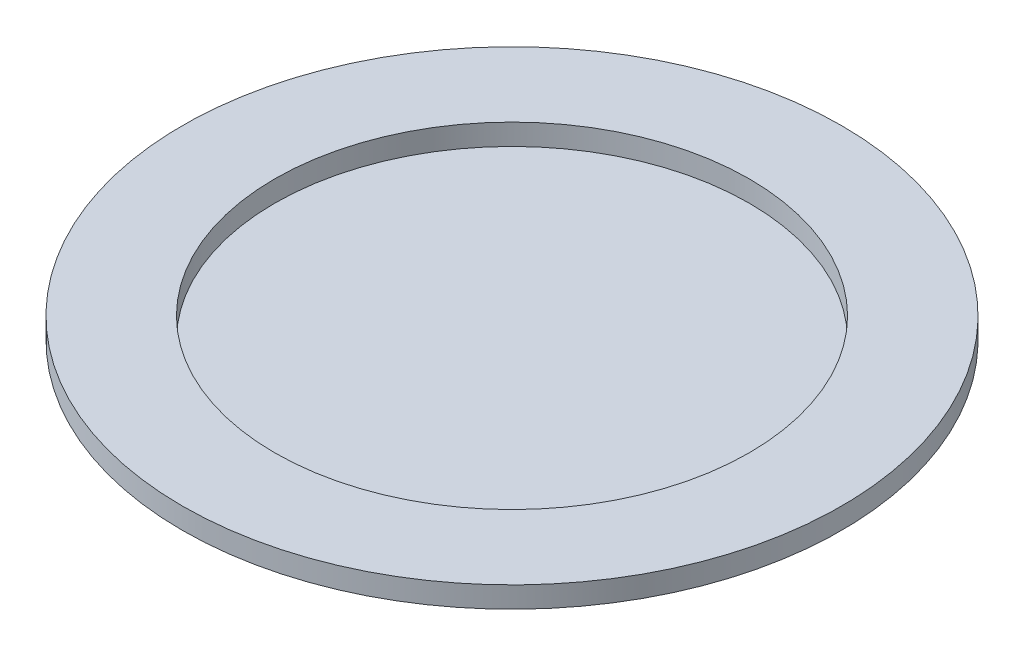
ISO-10303-21;
HEADER;
FILE_DESCRIPTION(('STEP AP214'),'2;1');
FILE_NAME('part.step','',(''),(''),'','','');
FILE_SCHEMA(('AUTOMOTIVE_DESIGN { 1 0 10303 214 1 1 1 1 }'));
ENDSEC;
DATA;
#1=APPLICATION_CONTEXT('core data for automotive mechanical design processes');
#2=APPLICATION_PROTOCOL_DEFINITION('international standard','automotive_design',2000,#1);
#3=PRODUCT_CONTEXT('',#1,'mechanical');
#4=PRODUCT('Part','Part','',(#3));
#5=PRODUCT_RELATED_PRODUCT_CATEGORY('part','',(#4));
#6=PRODUCT_DEFINITION_FORMATION('','',#4);
#7=PRODUCT_DEFINITION_CONTEXT('part definition',#1,'design');
#8=PRODUCT_DEFINITION('design','',#6,#7);
#9=PRODUCT_DEFINITION_SHAPE('','',#8);
#10=(LENGTH_UNIT() NAMED_UNIT(*) SI_UNIT(.MILLI.,.METRE.));
#11=(NAMED_UNIT(*) PLANE_ANGLE_UNIT() SI_UNIT($,.RADIAN.));
#12=(NAMED_UNIT(*) SI_UNIT($,.STERADIAN.) SOLID_ANGLE_UNIT());
#13=UNCERTAINTY_MEASURE_WITH_UNIT(LENGTH_MEASURE(1.E-05),#10,'distance_accuracy_value','');
#14=(GEOMETRIC_REPRESENTATION_CONTEXT(3) GLOBAL_UNCERTAINTY_ASSIGNED_CONTEXT((#13)) GLOBAL_UNIT_ASSIGNED_CONTEXT((#10,
#11,#12)) REPRESENTATION_CONTEXT('',''));
#15=CARTESIAN_POINT('',(0.,0.,0.));
#16=DIRECTION('',(0.,0.,1.));
#17=DIRECTION('',(1.,0.,0.));
#18=AXIS2_PLACEMENT_3D('',#15,#16,#17);
#19=CARTESIAN_POINT('',(0.,4.,0.));
#20=DIRECTION('',(0.,-1.,0.));
#21=DIRECTION('',(0.,0.,-1.));
#22=AXIS2_PLACEMENT_3D('',#19,#20,#21);
#23=CYLINDRICAL_SURFACE('',#22,50.);
#24=CARTESIAN_POINT('',(0.,4.,0.));
#25=DIRECTION('',(0.,1.,0.));
#26=DIRECTION('',(0.,0.,1.));
#27=AXIS2_PLACEMENT_3D('',#24,#25,#26);
#28=CIRCLE('',#27,50.);
#29=CARTESIAN_POINT('',(0.,4.,50.));
#30=VERTEX_POINT('',#29);
#31=EDGE_CURVE('E46',#30,#30,#28,.T.);
#32=ORIENTED_EDGE('',*,*,#31,.F.);
#33=EDGE_LOOP('',(#32));
#34=FACE_BOUND('',#33,.T.);
#35=CARTESIAN_POINT('',(0.,0.,0.));
#36=DIRECTION('',(0.,1.,0.));
#37=DIRECTION('',(0.,0.,1.));
#38=AXIS2_PLACEMENT_3D('',#35,#36,#37);
#39=CIRCLE('',#38,50.);
#40=CARTESIAN_POINT('',(0.,0.,50.));
#41=VERTEX_POINT('',#40);
#42=EDGE_CURVE('E51',#41,#41,#39,.T.);
#43=ORIENTED_EDGE('',*,*,#42,.T.);
#44=EDGE_LOOP('',(#43));
#45=FACE_BOUND('',#44,.T.);
#46=ADVANCED_FACE('F39',(#34,#45),#23,.T.);
#47=CARTESIAN_POINT('',(0.,0.,0.));
#48=DIRECTION('',(0.,1.,0.));
#49=DIRECTION('',(0.,0.,1.));
#50=AXIS2_PLACEMENT_3D('',#47,#48,#49);
#51=PLANE('',#50);
#52=ORIENTED_EDGE('',*,*,#42,.F.);
#53=EDGE_LOOP('',(#52));
#54=FACE_BOUND('',#53,.T.);
#55=ADVANCED_FACE('F76',(#54),#51,.F.);
#56=CARTESIAN_POINT('',(0.,8.,0.));
#57=DIRECTION('',(0.,1.,0.));
#58=DIRECTION('',(0.,0.,1.));
#59=AXIS2_PLACEMENT_3D('',#56,#57,#58);
#60=PLANE('',#59);
#61=CARTESIAN_POINT('',(0.,8.,0.));
#62=DIRECTION('',(0.,1.,0.));
#63=DIRECTION('',(0.,0.,1.));
#64=AXIS2_PLACEMENT_3D('',#61,#62,#63);
#65=CIRCLE('',#64,62.5);
#66=CARTESIAN_POINT('',(0.,8.,62.5));
#67=VERTEX_POINT('',#66);
#68=EDGE_CURVE('E57',#67,#67,#65,.T.);
#69=ORIENTED_EDGE('',*,*,#68,.T.);
#70=EDGE_LOOP('',(#69));
#71=FACE_BOUND('',#70,.T.);
#72=CARTESIAN_POINT('',(0.,8.,0.));
#73=DIRECTION('',(0.,1.,0.));
#74=DIRECTION('',(0.,0.,1.));
#75=AXIS2_PLACEMENT_3D('',#72,#73,#74);
#76=CIRCLE('',#75,45.);
#77=CARTESIAN_POINT('',(0.,8.,45.));
#78=VERTEX_POINT('',#77);
#79=EDGE_CURVE('E63',#78,#78,#76,.T.);
#80=ORIENTED_EDGE('',*,*,#79,.F.);
#81=EDGE_LOOP('',(#80));
#82=FACE_BOUND('',#81,.T.);
#83=ADVANCED_FACE('F73',(#71,#82),#60,.T.);
#84=CARTESIAN_POINT('',(0.,4.,0.));
#85=DIRECTION('',(0.,1.,0.));
#86=DIRECTION('',(0.,0.,1.));
#87=AXIS2_PLACEMENT_3D('',#84,#85,#86);
#88=PLANE('',#87);
#89=ORIENTED_EDGE('',*,*,#31,.T.);
#90=EDGE_LOOP('',(#89));
#91=FACE_BOUND('',#90,.T.);
#92=CARTESIAN_POINT('',(0.,4.,0.));
#93=DIRECTION('',(0.,1.,0.));
#94=DIRECTION('',(0.,0.,1.));
#95=AXIS2_PLACEMENT_3D('',#92,#93,#94);
#96=CIRCLE('',#95,62.5);
#97=CARTESIAN_POINT('',(0.,4.,62.5));
#98=VERTEX_POINT('',#97);
#99=EDGE_CURVE('E59',#98,#98,#96,.T.);
#100=ORIENTED_EDGE('',*,*,#99,.F.);
#101=EDGE_LOOP('',(#100));
#102=FACE_BOUND('',#101,.T.);
#103=ADVANCED_FACE('F75',(#91,#102),#88,.F.);
#104=CARTESIAN_POINT('',(0.,8.,0.));
#105=DIRECTION('',(0.,-1.,0.));
#106=DIRECTION('',(0.,0.,-1.));
#107=AXIS2_PLACEMENT_3D('',#104,#105,#106);
#108=CYLINDRICAL_SURFACE('',#107,62.5);
#109=ORIENTED_EDGE('',*,*,#68,.F.);
#110=EDGE_LOOP('',(#109));
#111=FACE_BOUND('',#110,.T.);
#112=ORIENTED_EDGE('',*,*,#99,.T.);
#113=EDGE_LOOP('',(#112));
#114=FACE_BOUND('',#113,.T.);
#115=ADVANCED_FACE('F83',(#111,#114),#108,.T.);
#116=CARTESIAN_POINT('',(0.,8.,0.));
#117=DIRECTION('',(0.,-1.,0.));
#118=DIRECTION('',(0.,0.,-1.));
#119=AXIS2_PLACEMENT_3D('',#116,#117,#118);
#120=CYLINDRICAL_SURFACE('',#119,45.);
#121=ORIENTED_EDGE('',*,*,#79,.T.);
#122=EDGE_LOOP('',(#121));
#123=FACE_BOUND('',#122,.T.);
#124=CARTESIAN_POINT('',(0.,4.,0.));
#125=DIRECTION('',(0.,1.,0.));
#126=DIRECTION('',(0.,0.,1.));
#127=AXIS2_PLACEMENT_3D('',#124,#125,#126);
#128=CIRCLE('',#127,45.);
#129=CARTESIAN_POINT('',(0.,4.,45.));
#130=VERTEX_POINT('',#129);
#131=EDGE_CURVE('E10',#130,#130,#128,.F.);
#132=ORIENTED_EDGE('',*,*,#131,.T.);
#133=EDGE_LOOP('',(#132));
#134=FACE_BOUND('',#133,.T.);
#135=ADVANCED_FACE('F71',(#123,#134),#120,.F.);
#136=CARTESIAN_POINT('',(0.,4.,0.));
#137=DIRECTION('',(0.,1.,0.));
#138=DIRECTION('',(0.,0.,1.));
#139=AXIS2_PLACEMENT_3D('',#136,#137,#138);
#140=PLANE('',#139);
#141=ORIENTED_EDGE('',*,*,#131,.F.);
#142=EDGE_LOOP('',(#141));
#143=FACE_BOUND('',#142,.T.);
#144=ADVANCED_FACE('F126',(#143),#140,.T.);
#145=CLOSED_SHELL('',(#46,#55,#83,#103,#115,#135,#144));
#146=MANIFOLD_SOLID_BREP('B2',#145);
#147=ADVANCED_BREP_SHAPE_REPRESENTATION('',(#18,#146),#14);
#148=SHAPE_DEFINITION_REPRESENTATION(#9,#147);
ENDSEC;
END-ISO-10303-21;
